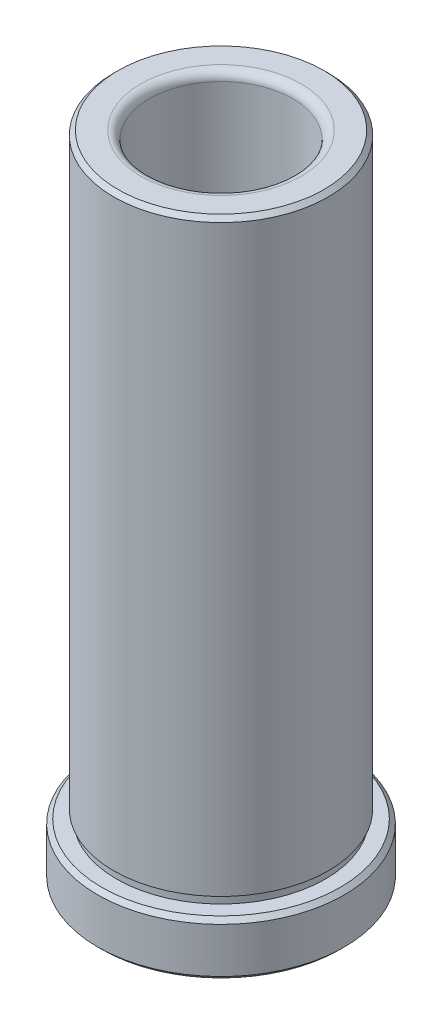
from build123d import *

# Parameters (mm, degrees)
FILLET1_R     = 0.762
CHAMFER1_SIZE = 0.762
CHAMFER2_SIZE = 0.381


with BuildPart() as part:
    # Sketch1 → Revolve1 (revolve)
    with BuildSketch(Plane.XY, mode=Mode.PRIVATE) as revolve1_sk:
        Polygon((6.3627, 57.785), (6.3627, 0), (10.9601, 0), (10.9601, 4.7752), (9.2837, 4.7752), (9.2837, 5.5372), (9.5377, 5.5372), (9.5377, 57.785), align=None)
    revolve(revolve1_sk.sketch.rotate(Axis((0, 33.463253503, 0), (0, -1, 0)), 90), axis=Axis((0, 33.463253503, 0), (0, -1, 0)))

    # Fillet1
    fillet1_edges = [part.edges().sort_by_distance(p)[0] for p in [
        (0, 57.785, -6.3627),
    ]]
    fillet(fillet1_edges, radius=FILLET1_R)

    # Chamfer1
    chamfer1_edges = [part.edges().sort_by_distance(p)[0] for p in [
        (0, 0, -6.3627),
    ]]
    chamfer(chamfer1_edges, length=CHAMFER1_SIZE)

    # Chamfer2
    chamfer2_edges = [part.edges().sort_by_distance(p)[0] for p in [
        (0, 0, -10.9601),
        (0, 4.7752, -10.9601),
        (0, 57.785, -9.5377),
    ]]
    chamfer(chamfer2_edges, length=CHAMFER2_SIZE)


solid = part.part
